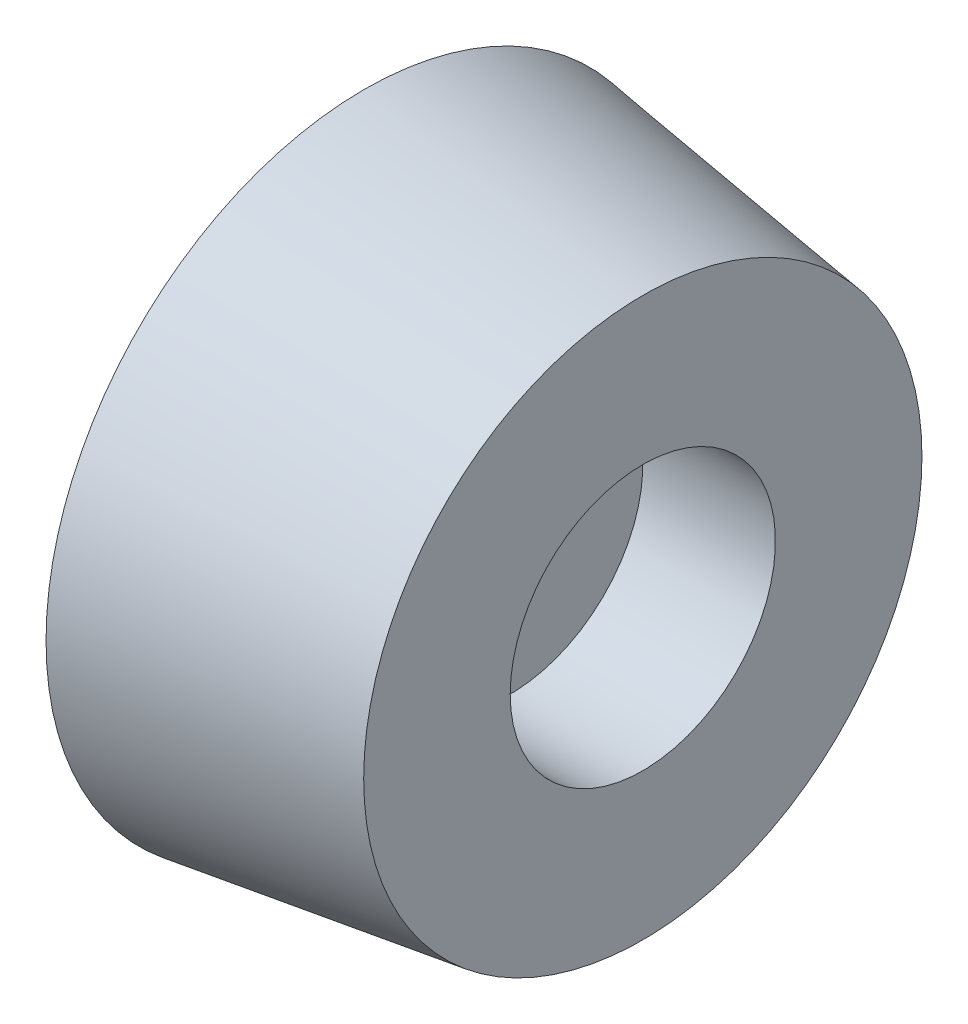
ISO-10303-21;
HEADER;
FILE_DESCRIPTION(('STEP AP214'),'2;1');
FILE_NAME('part.step','',(''),(''),'','','');
FILE_SCHEMA(('AUTOMOTIVE_DESIGN { 1 0 10303 214 1 1 1 1 }'));
ENDSEC;
DATA;
#1=APPLICATION_CONTEXT('core data for automotive mechanical design processes');
#2=APPLICATION_PROTOCOL_DEFINITION('international standard','automotive_design',2000,#1);
#3=PRODUCT_CONTEXT('',#1,'mechanical');
#4=PRODUCT('Part','Part','',(#3));
#5=PRODUCT_RELATED_PRODUCT_CATEGORY('part','',(#4));
#6=PRODUCT_DEFINITION_FORMATION('','',#4);
#7=PRODUCT_DEFINITION_CONTEXT('part definition',#1,'design');
#8=PRODUCT_DEFINITION('design','',#6,#7);
#9=PRODUCT_DEFINITION_SHAPE('','',#8);
#10=(LENGTH_UNIT() NAMED_UNIT(*) SI_UNIT(.MILLI.,.METRE.));
#11=(NAMED_UNIT(*) PLANE_ANGLE_UNIT() SI_UNIT($,.RADIAN.));
#12=(NAMED_UNIT(*) SI_UNIT($,.STERADIAN.) SOLID_ANGLE_UNIT());
#13=UNCERTAINTY_MEASURE_WITH_UNIT(LENGTH_MEASURE(1.E-05),#10,'distance_accuracy_value','');
#14=(GEOMETRIC_REPRESENTATION_CONTEXT(3) GLOBAL_UNCERTAINTY_ASSIGNED_CONTEXT((#13)) GLOBAL_UNIT_ASSIGNED_CONTEXT((#10,
#11,#12)) REPRESENTATION_CONTEXT('',''));
#15=CARTESIAN_POINT('',(0.,0.,0.));
#16=DIRECTION('',(0.,0.,1.));
#17=DIRECTION('',(1.,0.,0.));
#18=AXIS2_PLACEMENT_3D('',#15,#16,#17);
#19=CARTESIAN_POINT('',(0.,0.,0.));
#20=DIRECTION('',(-1.,0.,0.));
#21=DIRECTION('',(0.,0.,1.));
#22=AXIS2_PLACEMENT_3D('',#19,#20,#21);
#23=CYLINDRICAL_SURFACE('',#22,1.5);
#24=CARTESIAN_POINT('',(4.5,0.,0.));
#25=DIRECTION('',(-1.,0.,0.));
#26=DIRECTION('',(0.,0.,1.));
#27=AXIS2_PLACEMENT_3D('',#24,#25,#26);
#28=CIRCLE('',#27,1.5);
#29=CARTESIAN_POINT('',(4.5,0.,1.5));
#30=VERTEX_POINT('',#29);
#31=EDGE_CURVE('E10',#30,#30,#28,.T.);
#32=ORIENTED_EDGE('',*,*,#31,.F.);
#33=EDGE_LOOP('',(#32));
#34=FACE_BOUND('',#33,.T.);
#35=CARTESIAN_POINT('',(-0.999999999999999,0.,0.));
#36=DIRECTION('',(-1.,0.,0.));
#37=DIRECTION('',(0.,0.,1.));
#38=AXIS2_PLACEMENT_3D('',#35,#36,#37);
#39=CIRCLE('',#38,1.5);
#40=CARTESIAN_POINT('',(-0.999999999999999,0.,1.5));
#41=VERTEX_POINT('',#40);
#42=EDGE_CURVE('E57',#41,#41,#39,.T.);
#43=ORIENTED_EDGE('',*,*,#42,.T.);
#44=EDGE_LOOP('',(#43));
#45=FACE_BOUND('',#44,.T.);
#46=ADVANCED_FACE('F35',(#34,#45),#23,.F.);
#47=CARTESIAN_POINT('',(4.5,1.5,0.));
#48=DIRECTION('',(-1.,0.,0.));
#49=DIRECTION('',(0.,0.,1.));
#50=AXIS2_PLACEMENT_3D('',#47,#48,#49);
#51=PLANE('',#50);
#52=CARTESIAN_POINT('',(4.5,0.,0.));
#53=DIRECTION('',(-1.,0.,0.));
#54=DIRECTION('',(0.,0.,1.));
#55=AXIS2_PLACEMENT_3D('',#52,#53,#54);
#56=CIRCLE('',#55,5.);
#57=CARTESIAN_POINT('',(4.5,0.,5.));
#58=VERTEX_POINT('',#57);
#59=EDGE_CURVE('E41',#58,#58,#56,.T.);
#60=ORIENTED_EDGE('',*,*,#59,.F.);
#61=EDGE_LOOP('',(#60));
#62=FACE_BOUND('',#61,.T.);
#63=ORIENTED_EDGE('',*,*,#31,.T.);
#64=EDGE_LOOP('',(#63));
#65=FACE_BOUND('',#64,.T.);
#66=ADVANCED_FACE('F82',(#62,#65),#51,.F.);
#67=CARTESIAN_POINT('',(0.,0.,0.));
#68=DIRECTION('',(-1.,0.,0.));
#69=DIRECTION('',(0.,0.,1.));
#70=AXIS2_PLACEMENT_3D('',#67,#68,#69);
#71=CYLINDRICAL_SURFACE('',#70,5.);
#72=CARTESIAN_POINT('',(9.5,0.,0.));
#73=DIRECTION('',(-1.,0.,0.));
#74=DIRECTION('',(0.,0.,1.));
#75=AXIS2_PLACEMENT_3D('',#72,#73,#74);
#76=CIRCLE('',#75,5.);
#77=CARTESIAN_POINT('',(9.5,0.,5.));
#78=VERTEX_POINT('',#77);
#79=EDGE_CURVE('E45',#78,#78,#76,.T.);
#80=ORIENTED_EDGE('',*,*,#79,.F.);
#81=EDGE_LOOP('',(#80));
#82=FACE_BOUND('',#81,.T.);
#83=ORIENTED_EDGE('',*,*,#59,.T.);
#84=EDGE_LOOP('',(#83));
#85=FACE_BOUND('',#84,.T.);
#86=ADVANCED_FACE('F77',(#82,#85),#71,.F.);
#87=CARTESIAN_POINT('',(9.5,10.5243212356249,0.));
#88=DIRECTION('',(-1.,0.,0.));
#89=DIRECTION('',(0.,0.,1.));
#90=AXIS2_PLACEMENT_3D('',#87,#88,#89);
#91=PLANE('',#90);
#92=CARTESIAN_POINT('',(9.5,0.,0.));
#93=DIRECTION('',(-1.,0.,0.));
#94=DIRECTION('',(0.,0.,1.));
#95=AXIS2_PLACEMENT_3D('',#92,#93,#94);
#96=CIRCLE('',#95,10.5243212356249);
#97=CARTESIAN_POINT('',(9.5,0.,10.5243212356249));
#98=VERTEX_POINT('',#97);
#99=EDGE_CURVE('E49',#98,#98,#96,.T.);
#100=ORIENTED_EDGE('',*,*,#99,.F.);
#101=EDGE_LOOP('',(#100));
#102=FACE_BOUND('',#101,.T.);
#103=ORIENTED_EDGE('',*,*,#79,.T.);
#104=EDGE_LOOP('',(#103));
#105=FACE_BOUND('',#104,.T.);
#106=ADVANCED_FACE('F71',(#102,#105),#91,.F.);
#107=CARTESIAN_POINT('',(9.5,0.,0.));
#108=DIRECTION('',(-1.,0.,0.));
#109=DIRECTION('',(0.,0.,1.));
#110=AXIS2_PLACEMENT_3D('',#107,#108,#109);
#111=CONICAL_SURFACE('',#110,10.5243212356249,0.139626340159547);
#112=CARTESIAN_POINT('',(-1.,0.,0.));
#113=DIRECTION('',(-1.,0.,0.));
#114=DIRECTION('',(0.,0.,1.));
#115=AXIS2_PLACEMENT_3D('',#112,#113,#114);
#116=CIRCLE('',#115,12.);
#117=CARTESIAN_POINT('',(-1.,0.,12.));
#118=VERTEX_POINT('',#117);
#119=EDGE_CURVE('E54',#118,#118,#116,.T.);
#120=ORIENTED_EDGE('',*,*,#119,.F.);
#121=EDGE_LOOP('',(#120));
#122=FACE_BOUND('',#121,.T.);
#123=ORIENTED_EDGE('',*,*,#99,.T.);
#124=EDGE_LOOP('',(#123));
#125=FACE_BOUND('',#124,.T.);
#126=ADVANCED_FACE('F65',(#122,#125),#111,.T.);
#127=CARTESIAN_POINT('',(-1.,10.4852586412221,0.));
#128=DIRECTION('',(1.,0.,0.));
#129=DIRECTION('',(0.,0.,-1.));
#130=AXIS2_PLACEMENT_3D('',#127,#128,#129);
#131=PLANE('',#130);
#132=ORIENTED_EDGE('',*,*,#42,.F.);
#133=EDGE_LOOP('',(#132));
#134=FACE_BOUND('',#133,.T.);
#135=ORIENTED_EDGE('',*,*,#119,.T.);
#136=EDGE_LOOP('',(#135));
#137=FACE_BOUND('',#136,.T.);
#138=ADVANCED_FACE('F62',(#134,#137),#131,.F.);
#139=CLOSED_SHELL('',(#46,#66,#86,#106,#126,#138));
#140=MANIFOLD_SOLID_BREP('B2',#139);
#141=ADVANCED_BREP_SHAPE_REPRESENTATION('',(#18,#140),#14);
#142=SHAPE_DEFINITION_REPRESENTATION(#9,#141);
ENDSEC;
END-ISO-10303-21;
